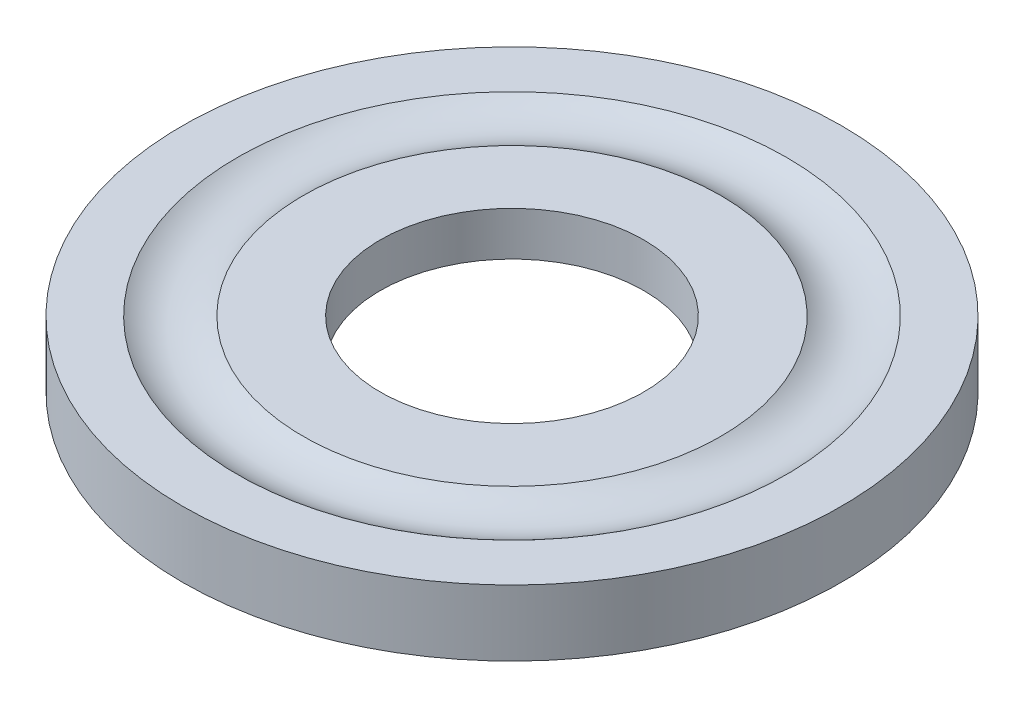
ISO-10303-21;
HEADER;
FILE_DESCRIPTION(('STEP AP214'),'2;1');
FILE_NAME('part.step','',(''),(''),'','','');
FILE_SCHEMA(('AUTOMOTIVE_DESIGN { 1 0 10303 214 1 1 1 1 }'));
ENDSEC;
DATA;
#1=APPLICATION_CONTEXT('core data for automotive mechanical design processes');
#2=APPLICATION_PROTOCOL_DEFINITION('international standard','automotive_design',2000,#1);
#3=PRODUCT_CONTEXT('',#1,'mechanical');
#4=PRODUCT('Part','Part','',(#3));
#5=PRODUCT_RELATED_PRODUCT_CATEGORY('part','',(#4));
#6=PRODUCT_DEFINITION_FORMATION('','',#4);
#7=PRODUCT_DEFINITION_CONTEXT('part definition',#1,'design');
#8=PRODUCT_DEFINITION('design','',#6,#7);
#9=PRODUCT_DEFINITION_SHAPE('','',#8);
#10=(LENGTH_UNIT() NAMED_UNIT(*) SI_UNIT(.MILLI.,.METRE.));
#11=(NAMED_UNIT(*) PLANE_ANGLE_UNIT() SI_UNIT($,.RADIAN.));
#12=(NAMED_UNIT(*) SI_UNIT($,.STERADIAN.) SOLID_ANGLE_UNIT());
#13=UNCERTAINTY_MEASURE_WITH_UNIT(LENGTH_MEASURE(1.E-05),#10,'distance_accuracy_value','');
#14=(GEOMETRIC_REPRESENTATION_CONTEXT(3) GLOBAL_UNCERTAINTY_ASSIGNED_CONTEXT((#13)) GLOBAL_UNIT_ASSIGNED_CONTEXT((#10,
#11,#12)) REPRESENTATION_CONTEXT('',''));
#15=CARTESIAN_POINT('',(0.,0.,0.));
#16=DIRECTION('',(0.,0.,1.));
#17=DIRECTION('',(1.,0.,0.));
#18=AXIS2_PLACEMENT_3D('',#15,#16,#17);
#19=CARTESIAN_POINT('',(0.,0.,0.));
#20=DIRECTION('',(0.,-1.,0.));
#21=DIRECTION('',(0.,0.,-1.));
#22=AXIS2_PLACEMENT_3D('',#19,#20,#21);
#23=CYLINDRICAL_SURFACE('',#22,6.);
#24=CARTESIAN_POINT('',(0.,2.,0.));
#25=DIRECTION('',(0.,-1.,0.));
#26=DIRECTION('',(0.,0.,-1.));
#27=AXIS2_PLACEMENT_3D('',#24,#25,#26);
#28=CIRCLE('',#27,6.);
#29=CARTESIAN_POINT('',(0.,2.,-6.));
#30=VERTEX_POINT('',#29);
#31=EDGE_CURVE('E10',#30,#30,#28,.T.);
#32=ORIENTED_EDGE('',*,*,#31,.F.);
#33=EDGE_LOOP('',(#32));
#34=FACE_BOUND('',#33,.T.);
#35=CARTESIAN_POINT('',(0.,0.,0.));
#36=DIRECTION('',(0.,-1.,0.));
#37=DIRECTION('',(0.,0.,-1.));
#38=AXIS2_PLACEMENT_3D('',#35,#36,#37);
#39=CIRCLE('',#38,6.);
#40=CARTESIAN_POINT('',(0.,0.,-6.));
#41=VERTEX_POINT('',#40);
#42=EDGE_CURVE('E376',#41,#41,#39,.T.);
#43=ORIENTED_EDGE('',*,*,#42,.T.);
#44=EDGE_LOOP('',(#43));
#45=FACE_BOUND('',#44,.T.);
#46=ADVANCED_FACE('F348',(#34,#45),#23,.F.);
#47=CARTESIAN_POINT('',(-6.,2.,0.));
#48=DIRECTION('',(0.,-1.,0.));
#49=DIRECTION('',(0.,0.,-1.));
#50=AXIS2_PLACEMENT_3D('',#47,#48,#49);
#51=PLANE('',#50);
#52=CARTESIAN_POINT('',(0.,2.,0.));
#53=DIRECTION('',(0.,-1.,0.));
#54=DIRECTION('',(0.,0.,-1.));
#55=AXIS2_PLACEMENT_3D('',#52,#53,#54);
#56=CIRCLE('',#55,9.5);
#57=CARTESIAN_POINT('',(0.,2.,-9.5));
#58=VERTEX_POINT('',#57);
#59=EDGE_CURVE('E354',#58,#58,#56,.T.);
#60=ORIENTED_EDGE('',*,*,#59,.F.);
#61=EDGE_LOOP('',(#60));
#62=FACE_BOUND('',#61,.T.);
#63=ORIENTED_EDGE('',*,*,#31,.T.);
#64=EDGE_LOOP('',(#63));
#65=FACE_BOUND('',#64,.T.);
#66=ADVANCED_FACE('F413',(#62,#65),#51,.F.);
#67=CARTESIAN_POINT('',(0.,4.,0.));
#68=DIRECTION('',(0.,-1.,0.));
#69=DIRECTION('',(0.,0.,-1.));
#70=AXIS2_PLACEMENT_3D('',#67,#68,#69);
#71=TOROIDAL_SURFACE('',#70,11.,2.5);
#72=CARTESIAN_POINT('',(0.,2.,0.));
#73=DIRECTION('',(0.,-1.,0.));
#74=DIRECTION('',(0.,0.,-1.));
#75=AXIS2_PLACEMENT_3D('',#72,#73,#74);
#76=CIRCLE('',#75,12.5);
#77=CARTESIAN_POINT('',(0.,2.,-12.5));
#78=VERTEX_POINT('',#77);
#79=EDGE_CURVE('E358',#78,#78,#76,.T.);
#80=ORIENTED_EDGE('',*,*,#79,.F.);
#81=EDGE_LOOP('',(#80));
#82=FACE_BOUND('',#81,.T.);
#83=ORIENTED_EDGE('',*,*,#59,.T.);
#84=EDGE_LOOP('',(#83));
#85=FACE_BOUND('',#84,.T.);
#86=ADVANCED_FACE('F408',(#82,#85),#71,.F.);
#87=CARTESIAN_POINT('',(-12.5,2.,0.));
#88=DIRECTION('',(0.,-1.,0.));
#89=DIRECTION('',(0.,0.,-1.));
#90=AXIS2_PLACEMENT_3D('',#87,#88,#89);
#91=PLANE('',#90);
#92=CARTESIAN_POINT('',(0.,2.,0.));
#93=DIRECTION('',(0.,-1.,0.));
#94=DIRECTION('',(0.,0.,-1.));
#95=AXIS2_PLACEMENT_3D('',#92,#93,#94);
#96=CIRCLE('',#95,15.);
#97=CARTESIAN_POINT('',(0.,2.,-15.));
#98=VERTEX_POINT('',#97);
#99=EDGE_CURVE('E362',#98,#98,#96,.T.);
#100=ORIENTED_EDGE('',*,*,#99,.F.);
#101=EDGE_LOOP('',(#100));
#102=FACE_BOUND('',#101,.T.);
#103=ORIENTED_EDGE('',*,*,#79,.T.);
#104=EDGE_LOOP('',(#103));
#105=FACE_BOUND('',#104,.T.);
#106=ADVANCED_FACE('F402',(#102,#105),#91,.F.);
#107=CARTESIAN_POINT('',(0.,0.,0.));
#108=DIRECTION('',(0.,-1.,0.));
#109=DIRECTION('',(0.,0.,-1.));
#110=AXIS2_PLACEMENT_3D('',#107,#108,#109);
#111=CYLINDRICAL_SURFACE('',#110,15.);
#112=CARTESIAN_POINT('',(0.,-1.,0.));
#113=DIRECTION('',(0.,-1.,0.));
#114=DIRECTION('',(0.,0.,-1.));
#115=AXIS2_PLACEMENT_3D('',#112,#113,#114);
#116=CIRCLE('',#115,15.);
#117=CARTESIAN_POINT('',(0.,-1.,-15.));
#118=VERTEX_POINT('',#117);
#119=EDGE_CURVE('E367',#118,#118,#116,.T.);
#120=ORIENTED_EDGE('',*,*,#119,.F.);
#121=EDGE_LOOP('',(#120));
#122=FACE_BOUND('',#121,.T.);
#123=ORIENTED_EDGE('',*,*,#99,.T.);
#124=EDGE_LOOP('',(#123));
#125=FACE_BOUND('',#124,.T.);
#126=ADVANCED_FACE('F396',(#122,#125),#111,.T.);
#127=CARTESIAN_POINT('',(-13.,-1.,0.));
#128=DIRECTION('',(0.,1.,0.));
#129=DIRECTION('',(0.,0.,1.));
#130=AXIS2_PLACEMENT_3D('',#127,#128,#129);
#131=PLANE('',#130);
#132=CARTESIAN_POINT('',(0.,-1.,0.));
#133=DIRECTION('',(0.,-1.,0.));
#134=DIRECTION('',(0.,0.,-1.));
#135=AXIS2_PLACEMENT_3D('',#132,#133,#134);
#136=CIRCLE('',#135,13.);
#137=CARTESIAN_POINT('',(0.,-1.,-13.));
#138=VERTEX_POINT('',#137);
#139=EDGE_CURVE('E370',#138,#138,#136,.T.);
#140=ORIENTED_EDGE('',*,*,#139,.F.);
#141=EDGE_LOOP('',(#140));
#142=FACE_BOUND('',#141,.T.);
#143=ORIENTED_EDGE('',*,*,#119,.T.);
#144=EDGE_LOOP('',(#143));
#145=FACE_BOUND('',#144,.T.);
#146=ADVANCED_FACE('F390',(#142,#145),#131,.F.);
#147=CARTESIAN_POINT('',(0.,0.,0.));
#148=DIRECTION('',(0.,-1.,0.));
#149=DIRECTION('',(0.,0.,-1.));
#150=AXIS2_PLACEMENT_3D('',#147,#148,#149);
#151=CYLINDRICAL_SURFACE('',#150,13.);
#152=CARTESIAN_POINT('',(0.,0.,0.));
#153=DIRECTION('',(0.,-1.,0.));
#154=DIRECTION('',(0.,0.,-1.));
#155=AXIS2_PLACEMENT_3D('',#152,#153,#154);
#156=CIRCLE('',#155,13.);
#157=CARTESIAN_POINT('',(0.,0.,-13.));
#158=VERTEX_POINT('',#157);
#159=EDGE_CURVE('E373',#158,#158,#156,.T.);
#160=ORIENTED_EDGE('',*,*,#159,.F.);
#161=EDGE_LOOP('',(#160));
#162=FACE_BOUND('',#161,.T.);
#163=ORIENTED_EDGE('',*,*,#139,.T.);
#164=EDGE_LOOP('',(#163));
#165=FACE_BOUND('',#164,.T.);
#166=ADVANCED_FACE('F384',(#162,#165),#151,.F.);
#167=CARTESIAN_POINT('',(-6.,0.,0.));
#168=DIRECTION('',(0.,1.,0.));
#169=DIRECTION('',(0.,0.,1.));
#170=AXIS2_PLACEMENT_3D('',#167,#168,#169);
#171=PLANE('',#170);
#172=ORIENTED_EDGE('',*,*,#42,.F.);
#173=EDGE_LOOP('',(#172));
#174=FACE_BOUND('',#173,.T.);
#175=ORIENTED_EDGE('',*,*,#159,.T.);
#176=EDGE_LOOP('',(#175));
#177=FACE_BOUND('',#176,.T.);
#178=ADVANCED_FACE('F381',(#174,#177),#171,.F.);
#179=CLOSED_SHELL('',(#46,#66,#86,#106,#126,#146,#166,#178));
#180=MANIFOLD_SOLID_BREP('B2',#179);
#181=ADVANCED_BREP_SHAPE_REPRESENTATION('',(#18,#180),#14);
#182=SHAPE_DEFINITION_REPRESENTATION(#9,#181);
ENDSEC;
END-ISO-10303-21;
